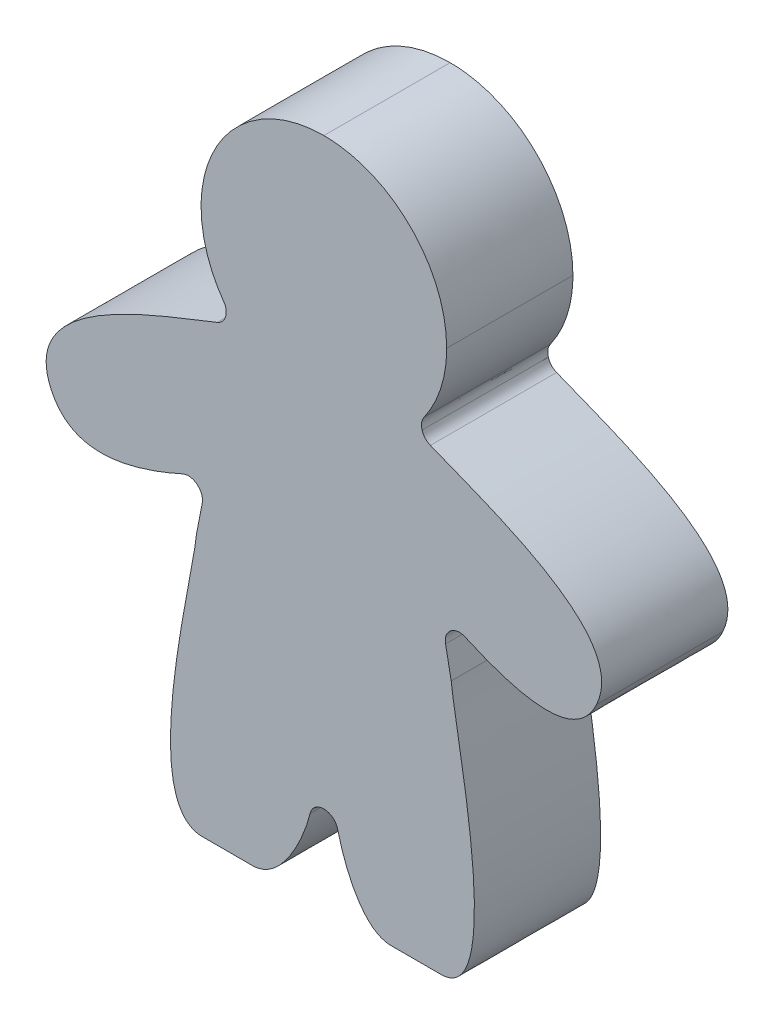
ISO-10303-21;
HEADER;
FILE_DESCRIPTION(('STEP AP214'),'2;1');
FILE_NAME('part.step','',(''),(''),'','','');
FILE_SCHEMA(('AUTOMOTIVE_DESIGN { 1 0 10303 214 1 1 1 1 }'));
ENDSEC;
DATA;
#1=APPLICATION_CONTEXT('core data for automotive mechanical design processes');
#2=APPLICATION_PROTOCOL_DEFINITION('international standard','automotive_design',2000,#1);
#3=PRODUCT_CONTEXT('',#1,'mechanical');
#4=PRODUCT('Part','Part','',(#3));
#5=PRODUCT_RELATED_PRODUCT_CATEGORY('part','',(#4));
#6=PRODUCT_DEFINITION_FORMATION('','',#4);
#7=PRODUCT_DEFINITION_CONTEXT('part definition',#1,'design');
#8=PRODUCT_DEFINITION('design','',#6,#7);
#9=PRODUCT_DEFINITION_SHAPE('','',#8);
#10=(LENGTH_UNIT() NAMED_UNIT(*) SI_UNIT(.MILLI.,.METRE.));
#11=(NAMED_UNIT(*) PLANE_ANGLE_UNIT() SI_UNIT($,.RADIAN.));
#12=(NAMED_UNIT(*) SI_UNIT($,.STERADIAN.) SOLID_ANGLE_UNIT());
#13=UNCERTAINTY_MEASURE_WITH_UNIT(LENGTH_MEASURE(1.E-05),#10,'distance_accuracy_value','');
#14=(GEOMETRIC_REPRESENTATION_CONTEXT(3) GLOBAL_UNCERTAINTY_ASSIGNED_CONTEXT((#13)) GLOBAL_UNIT_ASSIGNED_CONTEXT((#10,
#11,#12)) REPRESENTATION_CONTEXT('',''));
#15=CARTESIAN_POINT('',(0.,0.,0.));
#16=DIRECTION('',(0.,0.,1.));
#17=DIRECTION('',(1.,0.,0.));
#18=AXIS2_PLACEMENT_3D('',#15,#16,#17);
#19=CARTESIAN_POINT('',(349.810712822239,279.948315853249,8.));
#20=CARTESIAN_POINT('',(349.547732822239,280.055505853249,8.));
#21=CARTESIAN_POINT('',(349.365932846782,280.257105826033,8.));
#22=CARTESIAN_POINT('',(349.28637284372,280.529715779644,8.));
#23=B_SPLINE_CURVE_WITH_KNOTS('',3,(#19,#20,#21,#22),.UNSPECIFIED.,.F.,.F.,(4,4),
(0.925925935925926,1.),.UNSPECIFIED.);
#24=DIRECTION('',(0.,0.,-1.));
#25=VECTOR('',#24,1.);
#26=SURFACE_OF_LINEAR_EXTRUSION('',#23,#25);
#27=CARTESIAN_POINT('',(349.810712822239,279.948315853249,0.));
#28=CARTESIAN_POINT('',(349.547732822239,280.055505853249,0.));
#29=CARTESIAN_POINT('',(349.365932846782,280.257105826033,0.));
#30=CARTESIAN_POINT('',(349.28637284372,280.529715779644,0.));
#31=B_SPLINE_CURVE_WITH_KNOTS('',3,(#27,#28,#29,#30),.UNSPECIFIED.,.F.,.F.,(4,4),
(0.925925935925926,1.),.UNSPECIFIED.);
#32=CARTESIAN_POINT('',(349.810712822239,279.948315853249,0.));
#33=VERTEX_POINT('',#32);
#34=CARTESIAN_POINT('',(349.28637284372,280.529715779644,0.));
#35=VERTEX_POINT('',#34);
#36=EDGE_CURVE('E485',#33,#35,#31,.T.);
#37=ORIENTED_EDGE('',*,*,#36,.T.);
#38=DIRECTION('',(0.,0.,-1.));
#39=VECTOR('',#38,1.);
#40=CARTESIAN_POINT('',(349.28637284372,280.529715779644,8.));
#41=LINE('',#40,#39);
#42=CARTESIAN_POINT('',(349.28637284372,280.529715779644,8.));
#43=VERTEX_POINT('',#42);
#44=EDGE_CURVE('E11',#43,#35,#41,.T.);
#45=ORIENTED_EDGE('',*,*,#44,.F.);
#46=CARTESIAN_POINT('',(349.810712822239,279.948315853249,8.));
#47=VERTEX_POINT('',#46);
#48=EDGE_CURVE('E641',#47,#43,#23,.T.);
#49=ORIENTED_EDGE('',*,*,#48,.F.);
#50=DIRECTION('',(0.,0.,-1.));
#51=VECTOR('',#50,1.);
#52=CARTESIAN_POINT('',(349.810712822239,279.948315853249,8.));
#53=LINE('',#52,#51);
#54=EDGE_CURVE('E237',#47,#33,#53,.T.);
#55=ORIENTED_EDGE('',*,*,#54,.T.);
#56=EDGE_LOOP('',(#37,#45,#49,#55));
#57=FACE_BOUND('',#56,.T.);
#58=ADVANCED_FACE('F36',(#57),#26,.F.);
#59=CARTESIAN_POINT('',(349.28637284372,280.529715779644,8.));
#60=CARTESIAN_POINT('',(349.20681284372,280.802415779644,8.));
#61=CARTESIAN_POINT('',(349.251722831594,281.070165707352,8.));
#62=CARTESIAN_POINT('',(349.415882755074,281.301915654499,8.));
#63=B_SPLINE_CURVE_WITH_KNOTS('',3,(#59,#60,#61,#62),.UNSPECIFIED.,.F.,.F.,(4,4),
(0.888888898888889,0.925925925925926),.UNSPECIFIED.);
#64=DIRECTION('',(0.,0.,-1.));
#65=VECTOR('',#64,1.);
#66=SURFACE_OF_LINEAR_EXTRUSION('',#63,#65);
#67=CARTESIAN_POINT('',(349.28637284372,280.529715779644,0.));
#68=CARTESIAN_POINT('',(349.20681284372,280.802415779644,0.));
#69=CARTESIAN_POINT('',(349.251722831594,281.070165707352,0.));
#70=CARTESIAN_POINT('',(349.415882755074,281.301915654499,0.));
#71=B_SPLINE_CURVE_WITH_KNOTS('',3,(#67,#68,#69,#70),.UNSPECIFIED.,.F.,.F.,(4,4),
(0.888888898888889,0.925925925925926),.UNSPECIFIED.);
#72=CARTESIAN_POINT('',(349.415882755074,281.301915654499,0.));
#73=VERTEX_POINT('',#72);
#74=EDGE_CURVE('E479',#35,#73,#71,.T.);
#75=ORIENTED_EDGE('',*,*,#74,.T.);
#76=DIRECTION('',(0.,0.,-1.));
#77=VECTOR('',#76,1.);
#78=CARTESIAN_POINT('',(349.415882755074,281.301915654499,8.));
#79=LINE('',#78,#77);
#80=CARTESIAN_POINT('',(349.415882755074,281.301915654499,8.));
#81=VERTEX_POINT('',#80);
#82=EDGE_CURVE('E45',#81,#73,#79,.T.);
#83=ORIENTED_EDGE('',*,*,#82,.F.);
#84=EDGE_CURVE('E150',#43,#81,#63,.T.);
#85=ORIENTED_EDGE('',*,*,#84,.F.);
#86=ORIENTED_EDGE('',*,*,#44,.T.);
#87=EDGE_LOOP('',(#75,#83,#85,#86));
#88=FACE_BOUND('',#87,.T.);
#89=ADVANCED_FACE('F672',(#88),#66,.F.);
#90=CARTESIAN_POINT('',(349.415882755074,281.301915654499,8.));
#91=CARTESIAN_POINT('',(350.314532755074,282.570915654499,8.));
#92=CARTESIAN_POINT('',(350.842742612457,284.12098523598,8.));
#93=CARTESIAN_POINT('',(350.842742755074,285.794264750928,8.));
#94=B_SPLINE_CURVE_WITH_KNOTS('',3,(#90,#91,#92,#93),.UNSPECIFIED.,.F.,.F.,(4,4),
(0.851851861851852,0.888888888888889),.UNSPECIFIED.);
#95=DIRECTION('',(0.,0.,-1.));
#96=VECTOR('',#95,1.);
#97=SURFACE_OF_LINEAR_EXTRUSION('',#94,#96);
#98=CARTESIAN_POINT('',(349.415882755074,281.301915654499,0.));
#99=CARTESIAN_POINT('',(350.314532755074,282.570915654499,0.));
#100=CARTESIAN_POINT('',(350.842742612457,284.12098523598,0.));
#101=CARTESIAN_POINT('',(350.842742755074,285.794264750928,0.));
#102=B_SPLINE_CURVE_WITH_KNOTS('',3,(#98,#99,#100,#101),.UNSPECIFIED.,.F.,.F.,(4,4),
(0.851851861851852,0.888888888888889),.UNSPECIFIED.);
#103=CARTESIAN_POINT('',(350.842742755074,285.794264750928,0.));
#104=VERTEX_POINT('',#103);
#105=EDGE_CURVE('E473',#73,#104,#102,.T.);
#106=ORIENTED_EDGE('',*,*,#105,.T.);
#107=DIRECTION('',(0.,0.,-1.));
#108=VECTOR('',#107,1.);
#109=CARTESIAN_POINT('',(350.842742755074,285.794264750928,8.));
#110=LINE('',#109,#108);
#111=CARTESIAN_POINT('',(350.842742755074,285.794264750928,8.));
#112=VERTEX_POINT('',#111);
#113=EDGE_CURVE('E465',#112,#104,#110,.T.);
#114=ORIENTED_EDGE('',*,*,#113,.F.);
#115=EDGE_CURVE('E474',#81,#112,#94,.T.);
#116=ORIENTED_EDGE('',*,*,#115,.F.);
#117=ORIENTED_EDGE('',*,*,#82,.T.);
#118=EDGE_LOOP('',(#106,#114,#116,#117));
#119=FACE_BOUND('',#118,.T.);
#120=ADVANCED_FACE('F471',(#119),#97,.F.);
#121=CARTESIAN_POINT('',(350.842742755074,285.794264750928,8.));
#122=CARTESIAN_POINT('',(350.842744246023,290.092034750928,8.));
#123=CARTESIAN_POINT('',(347.358666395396,293.576115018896,8.));
#124=CARTESIAN_POINT('',(343.06089777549,293.576117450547,8.));
#125=B_SPLINE_CURVE_WITH_KNOTS('',3,(#121,#122,#123,#124),.UNSPECIFIED.,.F.,.F.,(4,4),
(0.814814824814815,0.851851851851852),.UNSPECIFIED.);
#126=DIRECTION('',(0.,0.,-1.));
#127=VECTOR('',#126,1.);
#128=SURFACE_OF_LINEAR_EXTRUSION('',#125,#127);
#129=CARTESIAN_POINT('',(350.842742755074,285.794264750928,0.));
#130=CARTESIAN_POINT('',(350.842744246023,290.092034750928,0.));
#131=CARTESIAN_POINT('',(347.358666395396,293.576115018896,0.));
#132=CARTESIAN_POINT('',(343.06089777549,293.576117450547,0.));
#133=B_SPLINE_CURVE_WITH_KNOTS('',3,(#129,#130,#131,#132),.UNSPECIFIED.,.F.,.F.,(4,4),
(0.814814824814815,0.851851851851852),.UNSPECIFIED.);
#134=CARTESIAN_POINT('',(343.06089777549,293.576117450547,0.));
#135=VERTEX_POINT('',#134);
#136=EDGE_CURVE('E481',#104,#135,#133,.T.);
#137=ORIENTED_EDGE('',*,*,#136,.T.);
#138=DIRECTION('',(0.,0.,-1.));
#139=VECTOR('',#138,1.);
#140=CARTESIAN_POINT('',(343.06089777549,293.576117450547,8.));
#141=LINE('',#140,#139);
#142=CARTESIAN_POINT('',(343.06089777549,293.576117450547,8.));
#143=VERTEX_POINT('',#142);
#144=EDGE_CURVE('E462',#143,#135,#141,.T.);
#145=ORIENTED_EDGE('',*,*,#144,.F.);
#146=EDGE_CURVE('E684',#112,#143,#125,.T.);
#147=ORIENTED_EDGE('',*,*,#146,.F.);
#148=ORIENTED_EDGE('',*,*,#113,.T.);
#149=EDGE_LOOP('',(#137,#145,#147,#148));
#150=FACE_BOUND('',#149,.T.);
#151=ADVANCED_FACE('F677',(#150),#128,.F.);
#152=CARTESIAN_POINT('',(343.06089777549,293.576117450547,8.));
#153=CARTESIAN_POINT('',(338.763127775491,293.576115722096,8.));
#154=CARTESIAN_POINT('',(335.279050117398,290.092035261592,8.));
#155=CARTESIAN_POINT('',(335.279050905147,285.794266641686,8.));
#156=B_SPLINE_CURVE_WITH_KNOTS('',3,(#152,#153,#154,#155),.UNSPECIFIED.,.F.,.F.,(4,4),
(0.777777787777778,0.814814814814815),.UNSPECIFIED.);
#157=DIRECTION('',(0.,0.,-1.));
#158=VECTOR('',#157,1.);
#159=SURFACE_OF_LINEAR_EXTRUSION('',#156,#158);
#160=CARTESIAN_POINT('',(343.06089777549,293.576117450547,0.));
#161=CARTESIAN_POINT('',(338.763127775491,293.576115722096,0.));
#162=CARTESIAN_POINT('',(335.279050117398,290.092035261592,0.));
#163=CARTESIAN_POINT('',(335.279050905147,285.794266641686,0.));
#164=B_SPLINE_CURVE_WITH_KNOTS('',3,(#160,#161,#162,#163),.UNSPECIFIED.,.F.,.F.,(4,4),
(0.777777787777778,0.814814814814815),.UNSPECIFIED.);
#165=CARTESIAN_POINT('',(335.279050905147,285.794266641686,0.));
#166=VERTEX_POINT('',#165);
#167=EDGE_CURVE('E483',#135,#166,#164,.T.);
#168=ORIENTED_EDGE('',*,*,#167,.T.);
#169=DIRECTION('',(0.,0.,-1.));
#170=VECTOR('',#169,1.);
#171=CARTESIAN_POINT('',(335.279050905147,285.794266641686,8.));
#172=LINE('',#171,#170);
#173=CARTESIAN_POINT('',(335.279050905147,285.794266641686,8.));
#174=VERTEX_POINT('',#173);
#175=EDGE_CURVE('E459',#174,#166,#172,.T.);
#176=ORIENTED_EDGE('',*,*,#175,.F.);
#177=EDGE_CURVE('E688',#143,#174,#156,.T.);
#178=ORIENTED_EDGE('',*,*,#177,.F.);
#179=ORIENTED_EDGE('',*,*,#144,.T.);
#180=EDGE_LOOP('',(#168,#176,#178,#179));
#181=FACE_BOUND('',#180,.T.);
#182=ADVANCED_FACE('F680',(#181),#159,.F.);
#183=CARTESIAN_POINT('',(335.279050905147,285.794266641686,8.));
#184=CARTESIAN_POINT('',(335.279050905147,284.120896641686,8.));
#185=CARTESIAN_POINT('',(335.80726076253,282.570917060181,8.));
#186=CARTESIAN_POINT('',(336.706000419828,281.301917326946,8.));
#187=B_SPLINE_CURVE_WITH_KNOTS('',3,(#183,#184,#185,#186),.UNSPECIFIED.,.F.,.F.,(4,4),
(0.740740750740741,0.777777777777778),.UNSPECIFIED.);
#188=DIRECTION('',(0.,0.,-1.));
#189=VECTOR('',#188,1.);
#190=SURFACE_OF_LINEAR_EXTRUSION('',#187,#189);
#191=CARTESIAN_POINT('',(335.279050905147,285.794266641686,0.));
#192=CARTESIAN_POINT('',(335.279050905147,284.120896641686,0.));
#193=CARTESIAN_POINT('',(335.80726076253,282.570917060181,0.));
#194=CARTESIAN_POINT('',(336.706000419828,281.301917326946,0.));
#195=B_SPLINE_CURVE_WITH_KNOTS('',3,(#191,#192,#193,#194),.UNSPECIFIED.,.F.,.F.,(4,4),
(0.740740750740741,0.777777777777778),.UNSPECIFIED.);
#196=CARTESIAN_POINT('',(336.706000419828,281.301917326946,0.));
#197=VERTEX_POINT('',#196);
#198=EDGE_CURVE('E503',#166,#197,#195,.T.);
#199=ORIENTED_EDGE('',*,*,#198,.T.);
#200=DIRECTION('',(0.,0.,-1.));
#201=VECTOR('',#200,1.);
#202=CARTESIAN_POINT('',(336.706000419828,281.301917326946,8.));
#203=LINE('',#202,#201);
#204=CARTESIAN_POINT('',(336.706000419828,281.301917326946,8.));
#205=VERTEX_POINT('',#204);
#206=EDGE_CURVE('E456',#205,#197,#203,.T.);
#207=ORIENTED_EDGE('',*,*,#206,.F.);
#208=EDGE_CURVE('E696',#174,#205,#187,.T.);
#209=ORIENTED_EDGE('',*,*,#208,.F.);
#210=ORIENTED_EDGE('',*,*,#175,.T.);
#211=EDGE_LOOP('',(#199,#207,#209,#210));
#212=FACE_BOUND('',#211,.T.);
#213=ADVANCED_FACE('F712',(#212),#190,.F.);
#214=CARTESIAN_POINT('',(336.706000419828,281.301917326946,8.));
#215=CARTESIAN_POINT('',(336.870160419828,281.070167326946,8.));
#216=CARTESIAN_POINT('',(336.915070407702,280.802417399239,8.));
#217=CARTESIAN_POINT('',(336.83551046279,280.529717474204,8.));
#218=B_SPLINE_CURVE_WITH_KNOTS('',3,(#214,#215,#216,#217),.UNSPECIFIED.,.F.,.F.,(4,4),
(0.703703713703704,0.740740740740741),.UNSPECIFIED.);
#219=DIRECTION('',(0.,0.,-1.));
#220=VECTOR('',#219,1.);
#221=SURFACE_OF_LINEAR_EXTRUSION('',#218,#220);
#222=CARTESIAN_POINT('',(336.706000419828,281.301917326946,0.));
#223=CARTESIAN_POINT('',(336.870160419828,281.070167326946,0.));
#224=CARTESIAN_POINT('',(336.915070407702,280.802417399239,0.));
#225=CARTESIAN_POINT('',(336.83551046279,280.529717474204,0.));
#226=B_SPLINE_CURVE_WITH_KNOTS('',3,(#222,#223,#224,#225),.UNSPECIFIED.,.F.,.F.,(4,4),
(0.703703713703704,0.740740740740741),.UNSPECIFIED.);
#227=CARTESIAN_POINT('',(336.83551046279,280.529717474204,0.));
#228=VERTEX_POINT('',#227);
#229=EDGE_CURVE('E510',#197,#228,#226,.T.);
#230=ORIENTED_EDGE('',*,*,#229,.T.);
#231=DIRECTION('',(0.,0.,-1.));
#232=VECTOR('',#231,1.);
#233=CARTESIAN_POINT('',(336.83551046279,280.529717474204,8.));
#234=LINE('',#233,#232);
#235=CARTESIAN_POINT('',(336.83551046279,280.529717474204,8.));
#236=VERTEX_POINT('',#235);
#237=EDGE_CURVE('E453',#236,#228,#234,.T.);
#238=ORIENTED_EDGE('',*,*,#237,.F.);
#239=EDGE_CURVE('E704',#205,#236,#218,.T.);
#240=ORIENTED_EDGE('',*,*,#239,.F.);
#241=ORIENTED_EDGE('',*,*,#206,.T.);
#242=EDGE_LOOP('',(#230,#238,#240,#241));
#243=FACE_BOUND('',#242,.T.);
#244=ADVANCED_FACE('F715',(#243),#221,.F.);
#245=CARTESIAN_POINT('',(336.83551046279,280.529717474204,8.));
#246=CARTESIAN_POINT('',(336.75595046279,280.257017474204,8.));
#247=CARTESIAN_POINT('',(336.574240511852,280.055417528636,8.));
#248=CARTESIAN_POINT('',(336.311170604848,279.948227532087,8.));
#249=B_SPLINE_CURVE_WITH_KNOTS('',3,(#245,#246,#247,#248),.UNSPECIFIED.,.F.,.F.,(4,4),
(0.666666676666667,0.703703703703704),.UNSPECIFIED.);
#250=DIRECTION('',(0.,0.,-1.));
#251=VECTOR('',#250,1.);
#252=SURFACE_OF_LINEAR_EXTRUSION('',#249,#251);
#253=CARTESIAN_POINT('',(336.83551046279,280.529717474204,0.));
#254=CARTESIAN_POINT('',(336.75595046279,280.257017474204,0.));
#255=CARTESIAN_POINT('',(336.574240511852,280.055417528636,0.));
#256=CARTESIAN_POINT('',(336.311170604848,279.948227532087,0.));
#257=B_SPLINE_CURVE_WITH_KNOTS('',3,(#253,#254,#255,#256),.UNSPECIFIED.,.F.,.F.,(4,4),
(0.666666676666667,0.703703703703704),.UNSPECIFIED.);
#258=CARTESIAN_POINT('',(336.311170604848,279.948227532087,0.));
#259=VERTEX_POINT('',#258);
#260=EDGE_CURVE('E517',#228,#259,#257,.T.);
#261=ORIENTED_EDGE('',*,*,#260,.T.);
#262=DIRECTION('',(0.,0.,-1.));
#263=VECTOR('',#262,1.);
#264=CARTESIAN_POINT('',(336.311170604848,279.948227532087,8.));
#265=LINE('',#264,#263);
#266=CARTESIAN_POINT('',(336.311170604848,279.948227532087,8.));
#267=VERTEX_POINT('',#266);
#268=EDGE_CURVE('E450',#267,#259,#265,.T.);
#269=ORIENTED_EDGE('',*,*,#268,.F.);
#270=EDGE_CURVE('E727',#236,#267,#249,.T.);
#271=ORIENTED_EDGE('',*,*,#270,.F.);
#272=ORIENTED_EDGE('',*,*,#237,.T.);
#273=EDGE_LOOP('',(#261,#269,#271,#272));
#274=FACE_BOUND('',#273,.T.);
#275=ADVANCED_FACE('F719',(#274),#252,.F.);
#276=CARTESIAN_POINT('',(336.311170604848,279.948227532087,8.));
#277=CARTESIAN_POINT('',(332.062810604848,278.218247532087,8.));
#278=CARTESIAN_POINT('',(323.70784286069,275.43697828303,8.));
#279=CARTESIAN_POINT('',(325.787469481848,270.977209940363,8.));
#280=B_SPLINE_CURVE_WITH_KNOTS('',3,(#276,#277,#278,#279),.UNSPECIFIED.,.F.,.F.,(4,4),
(0.62962963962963,0.666666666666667),.UNSPECIFIED.);
#281=DIRECTION('',(0.,0.,-1.));
#282=VECTOR('',#281,1.);
#283=SURFACE_OF_LINEAR_EXTRUSION('',#280,#282);
#284=CARTESIAN_POINT('',(336.311170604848,279.948227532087,0.));
#285=CARTESIAN_POINT('',(332.062810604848,278.218247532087,0.));
#286=CARTESIAN_POINT('',(323.70784286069,275.43697828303,0.));
#287=CARTESIAN_POINT('',(325.787469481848,270.977209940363,0.));
#288=B_SPLINE_CURVE_WITH_KNOTS('',3,(#284,#285,#286,#287),.UNSPECIFIED.,.F.,.F.,(4,4),
(0.62962963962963,0.666666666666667),.UNSPECIFIED.);
#289=CARTESIAN_POINT('',(325.787469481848,270.977209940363,0.));
#290=VERTEX_POINT('',#289);
#291=EDGE_CURVE('E524',#259,#290,#288,.T.);
#292=ORIENTED_EDGE('',*,*,#291,.T.);
#293=DIRECTION('',(0.,0.,-1.));
#294=VECTOR('',#293,1.);
#295=CARTESIAN_POINT('',(325.787469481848,270.977209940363,8.));
#296=LINE('',#295,#294);
#297=CARTESIAN_POINT('',(325.787469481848,270.977209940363,8.));
#298=VERTEX_POINT('',#297);
#299=EDGE_CURVE('E447',#298,#290,#296,.T.);
#300=ORIENTED_EDGE('',*,*,#299,.F.);
#301=EDGE_CURVE('E731',#267,#298,#280,.T.);
#302=ORIENTED_EDGE('',*,*,#301,.F.);
#303=ORIENTED_EDGE('',*,*,#268,.T.);
#304=EDGE_LOOP('',(#292,#300,#302,#303));
#305=FACE_BOUND('',#304,.T.);
#306=ADVANCED_FACE('F723',(#305),#283,.F.);
#307=CARTESIAN_POINT('',(325.787469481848,270.977209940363,8.));
#308=CARTESIAN_POINT('',(327.115779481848,268.128529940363,8.));
#309=CARTESIAN_POINT('',(330.656198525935,268.981369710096,8.));
#310=CARTESIAN_POINT('',(334.097707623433,270.527569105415,8.));
#311=B_SPLINE_CURVE_WITH_KNOTS('',3,(#307,#308,#309,#310),.UNSPECIFIED.,.F.,.F.,(4,4),
(0.592592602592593,0.62962962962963),.UNSPECIFIED.);
#312=DIRECTION('',(0.,0.,-1.));
#313=VECTOR('',#312,1.);
#314=SURFACE_OF_LINEAR_EXTRUSION('',#311,#313);
#315=CARTESIAN_POINT('',(325.787469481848,270.977209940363,0.));
#316=CARTESIAN_POINT('',(327.115779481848,268.128529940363,0.));
#317=CARTESIAN_POINT('',(330.656198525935,268.981369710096,0.));
#318=CARTESIAN_POINT('',(334.097707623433,270.527569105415,0.));
#319=B_SPLINE_CURVE_WITH_KNOTS('',3,(#315,#316,#317,#318),.UNSPECIFIED.,.F.,.F.,(4,4),
(0.592592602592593,0.62962962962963),.UNSPECIFIED.);
#320=CARTESIAN_POINT('',(334.097707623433,270.527569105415,0.));
#321=VERTEX_POINT('',#320);
#322=EDGE_CURVE('E531',#290,#321,#319,.T.);
#323=ORIENTED_EDGE('',*,*,#322,.T.);
#324=DIRECTION('',(0.,0.,-1.));
#325=VECTOR('',#324,1.);
#326=CARTESIAN_POINT('',(334.097707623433,270.527569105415,8.));
#327=LINE('',#326,#325);
#328=CARTESIAN_POINT('',(334.097707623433,270.527569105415,8.));
#329=VERTEX_POINT('',#328);
#330=EDGE_CURVE('E444',#329,#321,#327,.T.);
#331=ORIENTED_EDGE('',*,*,#330,.F.);
#332=EDGE_CURVE('E739',#298,#329,#311,.T.);
#333=ORIENTED_EDGE('',*,*,#332,.F.);
#334=ORIENTED_EDGE('',*,*,#299,.T.);
#335=EDGE_LOOP('',(#323,#331,#333,#334));
#336=FACE_BOUND('',#335,.T.);
#337=ADVANCED_FACE('F754',(#336),#314,.F.);
#338=CARTESIAN_POINT('',(334.097707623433,270.527569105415,8.));
#339=CARTESIAN_POINT('',(334.412077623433,270.668779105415,8.));
#340=CARTESIAN_POINT('',(334.755157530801,270.626119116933,8.));
#341=CARTESIAN_POINT('',(335.025337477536,270.412189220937,8.));
#342=B_SPLINE_CURVE_WITH_KNOTS('',3,(#338,#339,#340,#341),.UNSPECIFIED.,.F.,.F.,(4,4),
(0.555555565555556,0.592592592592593),.UNSPECIFIED.);
#343=DIRECTION('',(0.,0.,-1.));
#344=VECTOR('',#343,1.);
#345=SURFACE_OF_LINEAR_EXTRUSION('',#342,#344);
#346=CARTESIAN_POINT('',(334.097707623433,270.527569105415,0.));
#347=CARTESIAN_POINT('',(334.412077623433,270.668779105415,0.));
#348=CARTESIAN_POINT('',(334.755157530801,270.626119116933,0.));
#349=CARTESIAN_POINT('',(335.025337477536,270.412189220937,0.));
#350=B_SPLINE_CURVE_WITH_KNOTS('',3,(#346,#347,#348,#349),.UNSPECIFIED.,.F.,.F.,(4,4),
(0.555555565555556,0.592592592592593),.UNSPECIFIED.);
#351=CARTESIAN_POINT('',(335.025337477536,270.412189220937,0.));
#352=VERTEX_POINT('',#351);
#353=EDGE_CURVE('E538',#321,#352,#350,.T.);
#354=ORIENTED_EDGE('',*,*,#353,.T.);
#355=DIRECTION('',(0.,0.,-1.));
#356=VECTOR('',#355,1.);
#357=CARTESIAN_POINT('',(335.025337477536,270.412189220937,8.));
#358=LINE('',#357,#356);
#359=CARTESIAN_POINT('',(335.025337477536,270.412189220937,8.));
#360=VERTEX_POINT('',#359);
#361=EDGE_CURVE('E441',#360,#352,#358,.T.);
#362=ORIENTED_EDGE('',*,*,#361,.F.);
#363=EDGE_CURVE('E747',#329,#360,#342,.T.);
#364=ORIENTED_EDGE('',*,*,#363,.F.);
#365=ORIENTED_EDGE('',*,*,#330,.T.);
#366=EDGE_LOOP('',(#354,#362,#364,#365));
#367=FACE_BOUND('',#366,.T.);
#368=ADVANCED_FACE('F757',(#367),#345,.F.);
#369=CARTESIAN_POINT('',(335.025337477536,270.412189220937,8.));
#370=CARTESIAN_POINT('',(335.295517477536,270.198169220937,8.));
#371=CARTESIAN_POINT('',(335.41557744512,269.873989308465,8.));
#372=CARTESIAN_POINT('',(335.350147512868,269.535679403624,8.));
#373=B_SPLINE_CURVE_WITH_KNOTS('',3,(#369,#370,#371,#372),.UNSPECIFIED.,.F.,.F.,(4,4),
(0.518518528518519,0.555555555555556),.UNSPECIFIED.);
#374=DIRECTION('',(0.,0.,-1.));
#375=VECTOR('',#374,1.);
#376=SURFACE_OF_LINEAR_EXTRUSION('',#373,#375);
#377=CARTESIAN_POINT('',(335.025337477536,270.412189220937,0.));
#378=CARTESIAN_POINT('',(335.295517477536,270.198169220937,0.));
#379=CARTESIAN_POINT('',(335.41557744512,269.873989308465,0.));
#380=CARTESIAN_POINT('',(335.350147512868,269.535679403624,0.));
#381=B_SPLINE_CURVE_WITH_KNOTS('',3,(#377,#378,#379,#380),.UNSPECIFIED.,.F.,.F.,(4,4),
(0.518518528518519,0.555555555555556),.UNSPECIFIED.);
#382=CARTESIAN_POINT('',(335.350147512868,269.535679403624,0.));
#383=VERTEX_POINT('',#382);
#384=EDGE_CURVE('E545',#352,#383,#381,.T.);
#385=ORIENTED_EDGE('',*,*,#384,.T.);
#386=DIRECTION('',(0.,0.,-1.));
#387=VECTOR('',#386,1.);
#388=CARTESIAN_POINT('',(335.350147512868,269.535679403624,8.));
#389=LINE('',#388,#387);
#390=CARTESIAN_POINT('',(335.350147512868,269.535679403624,8.));
#391=VERTEX_POINT('',#390);
#392=EDGE_CURVE('E438',#391,#383,#389,.T.);
#393=ORIENTED_EDGE('',*,*,#392,.F.);
#394=EDGE_CURVE('E764',#360,#391,#373,.T.);
#395=ORIENTED_EDGE('',*,*,#394,.F.);
#396=ORIENTED_EDGE('',*,*,#361,.T.);
#397=EDGE_LOOP('',(#385,#393,#395,#396));
#398=FACE_BOUND('',#397,.T.);
#399=ADVANCED_FACE('F760',(#398),#376,.F.);
#400=CARTESIAN_POINT('',(335.350147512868,269.535679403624,8.));
#401=DIRECTION('',(0.981783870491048,-0.190001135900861,0.));
#402=DIRECTION('',(0.190001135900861,0.981783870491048,0.));
#403=AXIS2_PLACEMENT_3D('',#400,#401,#402);
#404=PLANE('',#403);
#405=CARTESIAN_POINT('',(335.350147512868,269.535679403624,0.));
#406=CARTESIAN_POINT('',(334.991767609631,267.683839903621,0.));
#407=CARTESIAN_POINT('',(334.991767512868,267.683839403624,0.));
#408=B_SPLINE_CURVE_WITH_KNOTS('',2,(#405,#406,#407),.UNSPECIFIED.,.F.,.F.,(3,3),
(0.481481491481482,0.518518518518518),.UNSPECIFIED.);
#409=CARTESIAN_POINT('',(334.991767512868,267.683839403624,0.));
#410=VERTEX_POINT('',#409);
#411=EDGE_CURVE('E552',#383,#410,#408,.T.);
#412=ORIENTED_EDGE('',*,*,#411,.T.);
#413=DIRECTION('',(0.,0.,-1.));
#414=VECTOR('',#413,1.);
#415=CARTESIAN_POINT('',(334.991767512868,267.683839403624,8.));
#416=LINE('',#415,#414);
#417=CARTESIAN_POINT('',(334.991767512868,267.683839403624,8.));
#418=VERTEX_POINT('',#417);
#419=EDGE_CURVE('E435',#418,#410,#416,.T.);
#420=ORIENTED_EDGE('',*,*,#419,.F.);
#421=CARTESIAN_POINT('',(335.350147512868,269.535679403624,8.));
#422=CARTESIAN_POINT('',(334.991767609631,267.683839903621,8.));
#423=CARTESIAN_POINT('',(334.991767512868,267.683839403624,8.));
#424=B_SPLINE_CURVE_WITH_KNOTS('',2,(#421,#422,#423),.UNSPECIFIED.,.F.,.F.,(3,3),
(0.481481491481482,0.518518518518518),.UNSPECIFIED.);
#425=EDGE_CURVE('E361',#391,#418,#424,.T.);
#426=ORIENTED_EDGE('',*,*,#425,.F.);
#427=ORIENTED_EDGE('',*,*,#392,.T.);
#428=EDGE_LOOP('',(#412,#420,#426,#427));
#429=FACE_BOUND('',#428,.T.);
#430=ADVANCED_FACE('F352',(#429),#404,.F.);
#431=CARTESIAN_POINT('',(334.991767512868,267.683839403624,8.));
#432=CARTESIAN_POINT('',(334.766137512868,265.105249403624,8.));
#433=CARTESIAN_POINT('',(331.154258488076,251.24660314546,8.));
#434=CARTESIAN_POINT('',(335.373095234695,251.246599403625,8.));
#435=B_SPLINE_CURVE_WITH_KNOTS('',3,(#431,#432,#433,#434),.UNSPECIFIED.,.F.,.F.,(4,4),
(0.444444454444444,0.481481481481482),.UNSPECIFIED.);
#436=DIRECTION('',(0.,0.,-1.));
#437=VECTOR('',#436,1.);
#438=SURFACE_OF_LINEAR_EXTRUSION('',#435,#437);
#439=CARTESIAN_POINT('',(334.991767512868,267.683839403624,0.));
#440=CARTESIAN_POINT('',(334.766137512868,265.105249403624,0.));
#441=CARTESIAN_POINT('',(331.154258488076,251.24660314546,0.));
#442=CARTESIAN_POINT('',(335.373095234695,251.246599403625,0.));
#443=B_SPLINE_CURVE_WITH_KNOTS('',3,(#439,#440,#441,#442),.UNSPECIFIED.,.F.,.F.,(4,4),
(0.444444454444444,0.481481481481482),.UNSPECIFIED.);
#444=CARTESIAN_POINT('',(335.373095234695,251.246599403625,0.));
#445=VERTEX_POINT('',#444);
#446=EDGE_CURVE('E559',#410,#445,#443,.T.);
#447=ORIENTED_EDGE('',*,*,#446,.T.);
#448=DIRECTION('',(0.,0.,-1.));
#449=VECTOR('',#448,1.);
#450=CARTESIAN_POINT('',(335.373095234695,251.246599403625,8.));
#451=LINE('',#450,#449);
#452=CARTESIAN_POINT('',(335.373095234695,251.246599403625,8.));
#453=VERTEX_POINT('',#452);
#454=EDGE_CURVE('E432',#453,#445,#451,.T.);
#455=ORIENTED_EDGE('',*,*,#454,.F.);
#456=EDGE_CURVE('E355',#418,#453,#435,.T.);
#457=ORIENTED_EDGE('',*,*,#456,.F.);
#458=ORIENTED_EDGE('',*,*,#419,.T.);
#459=EDGE_LOOP('',(#447,#455,#457,#458));
#460=FACE_BOUND('',#459,.T.);
#461=ADVANCED_FACE('F347',(#460),#438,.F.);
#462=CARTESIAN_POINT('',(335.373095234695,251.246599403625,8.));
#463=DIRECTION('',(0.,1.,0.));
#464=DIRECTION('',(-1.,0.,0.));
#465=AXIS2_PLACEMENT_3D('',#462,#463,#464);
#466=PLANE('',#465);
#467=CARTESIAN_POINT('',(335.373095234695,251.246599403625,0.));
#468=CARTESIAN_POINT('',(338.529844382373,251.246599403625,0.));
#469=CARTESIAN_POINT('',(338.529845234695,251.246599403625,0.));
#470=B_SPLINE_CURVE_WITH_KNOTS('',2,(#467,#468,#469),.UNSPECIFIED.,.F.,.F.,(3,3),
(0.407407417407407,0.444444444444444),.UNSPECIFIED.);
#471=CARTESIAN_POINT('',(338.529845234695,251.246599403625,0.));
#472=VERTEX_POINT('',#471);
#473=EDGE_CURVE('E566',#445,#472,#470,.T.);
#474=ORIENTED_EDGE('',*,*,#473,.T.);
#475=DIRECTION('',(0.,0.,-1.));
#476=VECTOR('',#475,1.);
#477=CARTESIAN_POINT('',(338.529845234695,251.246599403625,8.));
#478=LINE('',#477,#476);
#479=CARTESIAN_POINT('',(338.529845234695,251.246599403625,8.));
#480=VERTEX_POINT('',#479);
#481=EDGE_CURVE('E385',#480,#472,#478,.T.);
#482=ORIENTED_EDGE('',*,*,#481,.F.);
#483=CARTESIAN_POINT('',(335.373095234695,251.246599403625,8.));
#484=CARTESIAN_POINT('',(338.529844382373,251.246599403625,8.));
#485=CARTESIAN_POINT('',(338.529845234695,251.246599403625,8.));
#486=B_SPLINE_CURVE_WITH_KNOTS('',2,(#483,#484,#485),.UNSPECIFIED.,.F.,.F.,(3,3),
(0.407407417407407,0.444444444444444),.UNSPECIFIED.);
#487=EDGE_CURVE('E360',#453,#480,#486,.T.);
#488=ORIENTED_EDGE('',*,*,#487,.F.);
#489=ORIENTED_EDGE('',*,*,#454,.T.);
#490=EDGE_LOOP('',(#474,#482,#488,#489));
#491=FACE_BOUND('',#490,.T.);
#492=ADVANCED_FACE('F343',(#491),#466,.F.);
#493=CARTESIAN_POINT('',(338.529845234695,251.246599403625,8.));
#494=CARTESIAN_POINT('',(340.443245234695,251.246599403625,8.));
#495=CARTESIAN_POINT('',(341.837164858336,254.438898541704,8.));
#496=CARTESIAN_POINT('',(342.184835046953,255.924798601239,8.));
#497=B_SPLINE_CURVE_WITH_KNOTS('',3,(#493,#494,#495,#496),.UNSPECIFIED.,.F.,.F.,(4,4),
(0.37037038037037,0.407407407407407),.UNSPECIFIED.);
#498=DIRECTION('',(0.,0.,-1.));
#499=VECTOR('',#498,1.);
#500=SURFACE_OF_LINEAR_EXTRUSION('',#497,#499);
#501=CARTESIAN_POINT('',(338.529845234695,251.246599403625,0.));
#502=CARTESIAN_POINT('',(340.443245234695,251.246599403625,0.));
#503=CARTESIAN_POINT('',(341.837164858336,254.438898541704,0.));
#504=CARTESIAN_POINT('',(342.184835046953,255.924798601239,0.));
#505=B_SPLINE_CURVE_WITH_KNOTS('',3,(#501,#502,#503,#504),.UNSPECIFIED.,.F.,.F.,(4,4),
(0.37037038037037,0.407407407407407),.UNSPECIFIED.);
#506=CARTESIAN_POINT('',(342.184835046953,255.924798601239,0.));
#507=VERTEX_POINT('',#506);
#508=EDGE_CURVE('E383',#472,#507,#505,.T.);
#509=ORIENTED_EDGE('',*,*,#508,.T.);
#510=DIRECTION('',(0.,0.,-1.));
#511=VECTOR('',#510,1.);
#512=CARTESIAN_POINT('',(342.184835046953,255.924798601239,8.));
#513=LINE('',#512,#511);
#514=CARTESIAN_POINT('',(342.184835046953,255.924798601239,8.));
#515=VERTEX_POINT('',#514);
#516=EDGE_CURVE('E381',#515,#507,#513,.T.);
#517=ORIENTED_EDGE('',*,*,#516,.F.);
#518=EDGE_CURVE('E328',#480,#515,#497,.T.);
#519=ORIENTED_EDGE('',*,*,#518,.F.);
#520=ORIENTED_EDGE('',*,*,#481,.T.);
#521=EDGE_LOOP('',(#509,#517,#519,#520));
#522=FACE_BOUND('',#521,.T.);
#523=ADVANCED_FACE('F339',(#522),#500,.F.);
#524=CARTESIAN_POINT('',(342.184835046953,255.924798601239,8.));
#525=CARTESIAN_POINT('',(342.281045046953,256.336008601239,8.));
#526=CARTESIAN_POINT('',(342.637804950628,256.619508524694,8.));
#527=CARTESIAN_POINT('',(343.060894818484,256.619598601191,8.));
#528=B_SPLINE_CURVE_WITH_KNOTS('',3,(#524,#525,#526,#527),.UNSPECIFIED.,.F.,.F.,(4,4),
(0.333333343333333,0.37037037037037),.UNSPECIFIED.);
#529=DIRECTION('',(0.,0.,-1.));
#530=VECTOR('',#529,1.);
#531=SURFACE_OF_LINEAR_EXTRUSION('',#528,#530);
#532=CARTESIAN_POINT('',(342.184835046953,255.924798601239,0.));
#533=CARTESIAN_POINT('',(342.281045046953,256.336008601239,0.));
#534=CARTESIAN_POINT('',(342.637804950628,256.619508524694,0.));
#535=CARTESIAN_POINT('',(343.060894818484,256.619598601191,0.));
#536=B_SPLINE_CURVE_WITH_KNOTS('',3,(#532,#533,#534,#535),.UNSPECIFIED.,.F.,.F.,(4,4),
(0.333333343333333,0.37037037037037),.UNSPECIFIED.);
#537=CARTESIAN_POINT('',(343.060894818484,256.619598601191,0.));
#538=VERTEX_POINT('',#537);
#539=EDGE_CURVE('E390',#507,#538,#536,.T.);
#540=ORIENTED_EDGE('',*,*,#539,.T.);
#541=DIRECTION('',(0.,0.,-1.));
#542=VECTOR('',#541,1.);
#543=CARTESIAN_POINT('',(343.060894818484,256.619598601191,8.));
#544=LINE('',#543,#542);
#545=CARTESIAN_POINT('',(343.060894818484,256.619598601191,8.));
#546=VERTEX_POINT('',#545);
#547=EDGE_CURVE('E386',#546,#538,#544,.T.);
#548=ORIENTED_EDGE('',*,*,#547,.F.);
#549=EDGE_CURVE('E320',#515,#546,#528,.T.);
#550=ORIENTED_EDGE('',*,*,#549,.F.);
#551=ORIENTED_EDGE('',*,*,#516,.T.);
#552=EDGE_LOOP('',(#540,#548,#550,#551));
#553=FACE_BOUND('',#552,.T.);
#554=ADVANCED_FACE('F336',(#553),#531,.F.);
#555=CARTESIAN_POINT('',(343.060894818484,256.619598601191,8.));
#556=CARTESIAN_POINT('',(343.483894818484,256.619598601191,8.));
#557=CARTESIAN_POINT('',(343.84083472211,256.336098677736,8.));
#558=CARTESIAN_POINT('',(343.937044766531,255.924798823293,8.));
#559=B_SPLINE_CURVE_WITH_KNOTS('',3,(#555,#556,#557,#558),.UNSPECIFIED.,.F.,.F.,(4,4),
(0.296296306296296,0.333333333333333),.UNSPECIFIED.);
#560=DIRECTION('',(0.,0.,-1.));
#561=VECTOR('',#560,1.);
#562=SURFACE_OF_LINEAR_EXTRUSION('',#559,#561);
#563=CARTESIAN_POINT('',(343.060894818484,256.619598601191,0.));
#564=CARTESIAN_POINT('',(343.483894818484,256.619598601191,0.));
#565=CARTESIAN_POINT('',(343.84083472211,256.336098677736,0.));
#566=CARTESIAN_POINT('',(343.937044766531,255.924798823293,0.));
#567=B_SPLINE_CURVE_WITH_KNOTS('',3,(#563,#564,#565,#566),.UNSPECIFIED.,.F.,.F.,(4,4),
(0.296296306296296,0.333333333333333),.UNSPECIFIED.);
#568=CARTESIAN_POINT('',(343.937044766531,255.924798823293,0.));
#569=VERTEX_POINT('',#568);
#570=EDGE_CURVE('E585',#538,#569,#567,.T.);
#571=ORIENTED_EDGE('',*,*,#570,.T.);
#572=DIRECTION('',(0.,0.,-1.));
#573=VECTOR('',#572,1.);
#574=CARTESIAN_POINT('',(343.937044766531,255.924798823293,8.));
#575=LINE('',#574,#573);
#576=CARTESIAN_POINT('',(343.937044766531,255.924798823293,8.));
#577=VERTEX_POINT('',#576);
#578=EDGE_CURVE('E393',#577,#569,#575,.T.);
#579=ORIENTED_EDGE('',*,*,#578,.F.);
#580=EDGE_CURVE('E312',#546,#577,#559,.T.);
#581=ORIENTED_EDGE('',*,*,#580,.F.);
#582=ORIENTED_EDGE('',*,*,#547,.T.);
#583=EDGE_LOOP('',(#571,#579,#581,#582));
#584=FACE_BOUND('',#583,.T.);
#585=ADVANCED_FACE('F304',(#584),#562,.F.);
#586=CARTESIAN_POINT('',(343.937044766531,255.924798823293,8.));
#587=CARTESIAN_POINT('',(344.284714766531,254.438898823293,8.));
#588=CARTESIAN_POINT('',(345.408544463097,251.246599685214,8.));
#589=CARTESIAN_POINT('',(347.321943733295,251.246598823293,8.));
#590=B_SPLINE_CURVE_WITH_KNOTS('',3,(#586,#587,#588,#589),.UNSPECIFIED.,.F.,.F.,(4,4),
(0.259259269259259,0.296296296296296),.UNSPECIFIED.);
#591=DIRECTION('',(0.,0.,-1.));
#592=VECTOR('',#591,1.);
#593=SURFACE_OF_LINEAR_EXTRUSION('',#590,#592);
#594=CARTESIAN_POINT('',(343.937044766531,255.924798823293,0.));
#595=CARTESIAN_POINT('',(344.284714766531,254.438898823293,0.));
#596=CARTESIAN_POINT('',(345.408544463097,251.246599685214,0.));
#597=CARTESIAN_POINT('',(347.321943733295,251.246598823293,0.));
#598=B_SPLINE_CURVE_WITH_KNOTS('',3,(#594,#595,#596,#597),.UNSPECIFIED.,.F.,.F.,(4,4),
(0.259259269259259,0.296296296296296),.UNSPECIFIED.);
#599=CARTESIAN_POINT('',(347.321943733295,251.246598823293,0.));
#600=VERTEX_POINT('',#599);
#601=EDGE_CURVE('E404',#569,#600,#598,.T.);
#602=ORIENTED_EDGE('',*,*,#601,.T.);
#603=DIRECTION('',(0.,0.,-1.));
#604=VECTOR('',#603,1.);
#605=CARTESIAN_POINT('',(347.321943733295,251.246598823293,8.));
#606=LINE('',#605,#604);
#607=CARTESIAN_POINT('',(347.321943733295,251.246598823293,8.));
#608=VERTEX_POINT('',#607);
#609=EDGE_CURVE('E402',#608,#600,#606,.T.);
#610=ORIENTED_EDGE('',*,*,#609,.F.);
#611=EDGE_CURVE('E308',#577,#608,#590,.T.);
#612=ORIENTED_EDGE('',*,*,#611,.F.);
#613=ORIENTED_EDGE('',*,*,#578,.T.);
#614=EDGE_LOOP('',(#602,#610,#612,#613));
#615=FACE_BOUND('',#614,.T.);
#616=ADVANCED_FACE('F300',(#615),#593,.F.);
#617=CARTESIAN_POINT('',(347.321943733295,251.246598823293,8.));
#618=DIRECTION('',(0.,1.,0.));
#619=DIRECTION('',(0.,0.,1.));
#620=AXIS2_PLACEMENT_3D('',#617,#618,#619);
#621=PLANE('',#620);
#622=CARTESIAN_POINT('',(347.321943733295,251.246598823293,0.));
#623=CARTESIAN_POINT('',(350.478782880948,251.246598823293,0.));
#624=CARTESIAN_POINT('',(350.478783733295,251.246598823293,0.));
#625=B_SPLINE_CURVE_WITH_KNOTS('',2,(#622,#623,#624),.UNSPECIFIED.,.F.,.F.,(3,3),
(0.222222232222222,0.259259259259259),.UNSPECIFIED.);
#626=CARTESIAN_POINT('',(350.478783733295,251.246598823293,0.));
#627=VERTEX_POINT('',#626);
#628=EDGE_CURVE('E410',#600,#627,#625,.T.);
#629=ORIENTED_EDGE('',*,*,#628,.T.);
#630=DIRECTION('',(0.,0.,-1.));
#631=VECTOR('',#630,1.);
#632=CARTESIAN_POINT('',(350.478783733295,251.246598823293,8.));
#633=LINE('',#632,#631);
#634=CARTESIAN_POINT('',(350.478783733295,251.246598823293,8.));
#635=VERTEX_POINT('',#634);
#636=EDGE_CURVE('E406',#635,#627,#633,.T.);
#637=ORIENTED_EDGE('',*,*,#636,.F.);
#638=CARTESIAN_POINT('',(347.321943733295,251.246598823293,8.));
#639=CARTESIAN_POINT('',(350.478782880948,251.246598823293,8.));
#640=CARTESIAN_POINT('',(350.478783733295,251.246598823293,8.));
#641=B_SPLINE_CURVE_WITH_KNOTS('',2,(#638,#639,#640),.UNSPECIFIED.,.F.,.F.,(3,3),
(0.222222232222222,0.259259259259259),.UNSPECIFIED.);
#642=EDGE_CURVE('E286',#608,#635,#641,.T.);
#643=ORIENTED_EDGE('',*,*,#642,.F.);
#644=ORIENTED_EDGE('',*,*,#609,.T.);
#645=EDGE_LOOP('',(#629,#637,#643,#644));
#646=FACE_BOUND('',#645,.T.);
#647=ADVANCED_FACE('F296',(#646),#621,.F.);
#648=CARTESIAN_POINT('',(350.478783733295,251.246598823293,8.));
#649=CARTESIAN_POINT('',(354.697893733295,251.246598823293,8.));
#650=CARTESIAN_POINT('',(351.355834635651,265.105245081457,8.));
#651=CARTESIAN_POINT('',(351.130203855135,267.683837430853,8.));
#652=B_SPLINE_CURVE_WITH_KNOTS('',3,(#648,#649,#650,#651),.UNSPECIFIED.,.F.,.F.,(4,4),
(0.185185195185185,0.222222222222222),.UNSPECIFIED.);
#653=DIRECTION('',(0.,0.,-1.));
#654=VECTOR('',#653,1.);
#655=SURFACE_OF_LINEAR_EXTRUSION('',#652,#654);
#656=CARTESIAN_POINT('',(350.478783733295,251.246598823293,0.));
#657=CARTESIAN_POINT('',(354.697893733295,251.246598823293,0.));
#658=CARTESIAN_POINT('',(351.355834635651,265.105245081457,0.));
#659=CARTESIAN_POINT('',(351.130203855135,267.683837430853,0.));
#660=B_SPLINE_CURVE_WITH_KNOTS('',3,(#656,#657,#658,#659),.UNSPECIFIED.,.F.,.F.,(4,4),
(0.185185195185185,0.222222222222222),.UNSPECIFIED.);
#661=CARTESIAN_POINT('',(351.130203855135,267.683837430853,0.));
#662=VERTEX_POINT('',#661);
#663=EDGE_CURVE('E604',#627,#662,#660,.T.);
#664=ORIENTED_EDGE('',*,*,#663,.T.);
#665=DIRECTION('',(0.,0.,-1.));
#666=VECTOR('',#665,1.);
#667=CARTESIAN_POINT('',(351.130203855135,267.683837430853,8.));
#668=LINE('',#667,#666);
#669=CARTESIAN_POINT('',(351.130203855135,267.683837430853,8.));
#670=VERTEX_POINT('',#669);
#671=EDGE_CURVE('E412',#670,#662,#668,.T.);
#672=ORIENTED_EDGE('',*,*,#671,.F.);
#673=EDGE_CURVE('E278',#635,#670,#652,.T.);
#674=ORIENTED_EDGE('',*,*,#673,.F.);
#675=ORIENTED_EDGE('',*,*,#636,.T.);
#676=EDGE_LOOP('',(#664,#672,#674,#675));
#677=FACE_BOUND('',#676,.T.);
#678=ADVANCED_FACE('F293',(#677),#655,.F.);
#679=CARTESIAN_POINT('',(351.130203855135,267.683837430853,8.));
#680=DIRECTION('',(-0.981782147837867,-0.190010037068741,0.));
#681=DIRECTION('',(0.190010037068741,-0.981782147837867,0.));
#682=AXIS2_PLACEMENT_3D('',#679,#680,#681);
#683=PLANE('',#682);
#684=CARTESIAN_POINT('',(351.130203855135,267.683837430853,0.));
#685=CARTESIAN_POINT('',(350.771823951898,269.535586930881,0.));
#686=CARTESIAN_POINT('',(350.771823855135,269.535587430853,0.));
#687=B_SPLINE_CURVE_WITH_KNOTS('',2,(#684,#685,#686),.UNSPECIFIED.,.F.,.F.,(3,3),
(0.148148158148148,0.185185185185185),.UNSPECIFIED.);
#688=CARTESIAN_POINT('',(350.771823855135,269.535587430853,0.));
#689=VERTEX_POINT('',#688);
#690=EDGE_CURVE('E422',#662,#689,#687,.T.);
#691=ORIENTED_EDGE('',*,*,#690,.T.);
#692=DIRECTION('',(0.,0.,-1.));
#693=VECTOR('',#692,1.);
#694=CARTESIAN_POINT('',(350.771823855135,269.535587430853,8.));
#695=LINE('',#694,#693);
#696=CARTESIAN_POINT('',(350.771823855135,269.535587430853,8.));
#697=VERTEX_POINT('',#696);
#698=EDGE_CURVE('E420',#697,#689,#695,.T.);
#699=ORIENTED_EDGE('',*,*,#698,.F.);
#700=CARTESIAN_POINT('',(351.130203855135,267.683837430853,8.));
#701=CARTESIAN_POINT('',(350.771823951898,269.535586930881,8.));
#702=CARTESIAN_POINT('',(350.771823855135,269.535587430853,8.));
#703=B_SPLINE_CURVE_WITH_KNOTS('',2,(#700,#701,#702),.UNSPECIFIED.,.F.,.F.,(3,3),
(0.148148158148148,0.185185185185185),.UNSPECIFIED.);
#704=EDGE_CURVE('E271',#670,#697,#703,.T.);
#705=ORIENTED_EDGE('',*,*,#704,.F.);
#706=ORIENTED_EDGE('',*,*,#671,.T.);
#707=EDGE_LOOP('',(#691,#699,#705,#706));
#708=FACE_BOUND('',#707,.T.);
#709=ADVANCED_FACE('F264',(#708),#683,.F.);
#710=CARTESIAN_POINT('',(350.771823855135,269.535587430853,8.));
#711=CARTESIAN_POINT('',(350.706393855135,269.873897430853,8.));
#712=CARTESIAN_POINT('',(350.826453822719,270.198077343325,8.));
#713=CARTESIAN_POINT('',(351.096633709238,270.412097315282,8.));
#714=B_SPLINE_CURVE_WITH_KNOTS('',3,(#710,#711,#712,#713),.UNSPECIFIED.,.F.,.F.,(4,4),
(0.111111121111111,0.148148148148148),.UNSPECIFIED.);
#715=DIRECTION('',(0.,0.,-1.));
#716=VECTOR('',#715,1.);
#717=SURFACE_OF_LINEAR_EXTRUSION('',#714,#716);
#718=CARTESIAN_POINT('',(350.771823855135,269.535587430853,0.));
#719=CARTESIAN_POINT('',(350.706393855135,269.873897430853,0.));
#720=CARTESIAN_POINT('',(350.826453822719,270.198077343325,0.));
#721=CARTESIAN_POINT('',(351.096633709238,270.412097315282,0.));
#722=B_SPLINE_CURVE_WITH_KNOTS('',3,(#718,#719,#720,#721),.UNSPECIFIED.,.F.,.F.,(4,4),
(0.111111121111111,0.148148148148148),.UNSPECIFIED.);
#723=CARTESIAN_POINT('',(351.096633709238,270.412097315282,0.));
#724=VERTEX_POINT('',#723);
#725=EDGE_CURVE('E425',#689,#724,#722,.T.);
#726=ORIENTED_EDGE('',*,*,#725,.T.);
#727=DIRECTION('',(0.,0.,-1.));
#728=VECTOR('',#727,1.);
#729=CARTESIAN_POINT('',(351.096633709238,270.412097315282,8.));
#730=LINE('',#729,#728);
#731=CARTESIAN_POINT('',(351.096633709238,270.412097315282,8.));
#732=VERTEX_POINT('',#731);
#733=EDGE_CURVE('E232',#732,#724,#730,.T.);
#734=ORIENTED_EDGE('',*,*,#733,.F.);
#735=EDGE_CURVE('E223',#697,#732,#714,.T.);
#736=ORIENTED_EDGE('',*,*,#735,.F.);
#737=ORIENTED_EDGE('',*,*,#698,.T.);
#738=EDGE_LOOP('',(#726,#734,#736,#737));
#739=FACE_BOUND('',#738,.T.);
#740=ADVANCED_FACE('F261',(#739),#717,.F.);
#741=CARTESIAN_POINT('',(351.096633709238,270.412097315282,8.));
#742=CARTESIAN_POINT('',(351.366813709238,270.626027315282,8.));
#743=CARTESIAN_POINT('',(351.709893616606,270.668687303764,8.));
#744=CARTESIAN_POINT('',(352.024263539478,270.527477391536,8.));
#745=B_SPLINE_CURVE_WITH_KNOTS('',3,(#741,#742,#743,#744),.UNSPECIFIED.,.F.,.F.,(4,4),
(0.0740740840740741,0.111111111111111),.UNSPECIFIED.);
#746=DIRECTION('',(0.,0.,-1.));
#747=VECTOR('',#746,1.);
#748=SURFACE_OF_LINEAR_EXTRUSION('',#745,#747);
#749=CARTESIAN_POINT('',(351.096633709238,270.412097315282,0.));
#750=CARTESIAN_POINT('',(351.366813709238,270.626027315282,0.));
#751=CARTESIAN_POINT('',(351.709893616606,270.668687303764,0.));
#752=CARTESIAN_POINT('',(352.024263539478,270.527477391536,0.));
#753=B_SPLINE_CURVE_WITH_KNOTS('',3,(#749,#750,#751,#752),.UNSPECIFIED.,.F.,.F.,(4,4),
(0.0740740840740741,0.111111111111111),.UNSPECIFIED.);
#754=CARTESIAN_POINT('',(352.024263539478,270.527477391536,0.));
#755=VERTEX_POINT('',#754);
#756=EDGE_CURVE('E231',#724,#755,#753,.T.);
#757=ORIENTED_EDGE('',*,*,#756,.T.);
#758=DIRECTION('',(0.,0.,-1.));
#759=VECTOR('',#758,1.);
#760=CARTESIAN_POINT('',(352.024263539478,270.527477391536,8.));
#761=LINE('',#760,#759);
#762=CARTESIAN_POINT('',(352.024263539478,270.527477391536,8.));
#763=VERTEX_POINT('',#762);
#764=EDGE_CURVE('E228',#763,#755,#761,.T.);
#765=ORIENTED_EDGE('',*,*,#764,.F.);
#766=EDGE_CURVE('E217',#732,#763,#745,.T.);
#767=ORIENTED_EDGE('',*,*,#766,.F.);
#768=ORIENTED_EDGE('',*,*,#733,.T.);
#769=EDGE_LOOP('',(#757,#765,#767,#768));
#770=FACE_BOUND('',#769,.T.);
#771=ADVANCED_FACE('F229',(#770),#748,.F.);
#772=CARTESIAN_POINT('',(352.024263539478,270.527477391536,8.));
#773=CARTESIAN_POINT('',(355.465773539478,268.981367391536,8.));
#774=CARTESIAN_POINT('',(359.006192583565,268.128437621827,8.));
#775=CARTESIAN_POINT('',(360.334412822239,270.977115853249,8.));
#776=B_SPLINE_CURVE_WITH_KNOTS('',3,(#772,#773,#774,#775),.UNSPECIFIED.,.F.,.F.,(4,4),
(0.037037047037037,0.0740740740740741),.UNSPECIFIED.);
#777=DIRECTION('',(0.,0.,-1.));
#778=VECTOR('',#777,1.);
#779=SURFACE_OF_LINEAR_EXTRUSION('',#776,#778);
#780=CARTESIAN_POINT('',(352.024263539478,270.527477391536,0.));
#781=CARTESIAN_POINT('',(355.465773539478,268.981367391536,0.));
#782=CARTESIAN_POINT('',(359.006192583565,268.128437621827,0.));
#783=CARTESIAN_POINT('',(360.334412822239,270.977115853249,0.));
#784=B_SPLINE_CURVE_WITH_KNOTS('',3,(#780,#781,#782,#783),.UNSPECIFIED.,.F.,.F.,(4,4),
(0.037037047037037,0.0740740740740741),.UNSPECIFIED.);
#785=CARTESIAN_POINT('',(360.334412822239,270.977115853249,0.));
#786=VERTEX_POINT('',#785);
#787=EDGE_CURVE('E136',#755,#786,#784,.T.);
#788=ORIENTED_EDGE('',*,*,#787,.T.);
#789=DIRECTION('',(0.,0.,-1.));
#790=VECTOR('',#789,1.);
#791=CARTESIAN_POINT('',(360.334412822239,270.977115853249,8.));
#792=LINE('',#791,#790);
#793=CARTESIAN_POINT('',(360.334412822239,270.977115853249,8.));
#794=VERTEX_POINT('',#793);
#795=EDGE_CURVE('E233',#794,#786,#792,.T.);
#796=ORIENTED_EDGE('',*,*,#795,.F.);
#797=EDGE_CURVE('E221',#763,#794,#776,.T.);
#798=ORIENTED_EDGE('',*,*,#797,.F.);
#799=ORIENTED_EDGE('',*,*,#764,.T.);
#800=EDGE_LOOP('',(#788,#796,#798,#799));
#801=FACE_BOUND('',#800,.T.);
#802=ADVANCED_FACE('F235',(#801),#779,.F.);
#803=CARTESIAN_POINT('',(360.334412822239,270.977115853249,8.));
#804=CARTESIAN_POINT('',(362.414042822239,275.436975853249,8.));
#805=CARTESIAN_POINT('',(354.058982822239,278.218335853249,8.));
#806=CARTESIAN_POINT('',(349.810712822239,279.948315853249,8.));
#807=B_SPLINE_CURVE_WITH_KNOTS('',3,(#803,#804,#805,#806),.UNSPECIFIED.,.F.,.F.,(4,4),(0.,
0.037037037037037),.UNSPECIFIED.);
#808=DIRECTION('',(0.,0.,-1.));
#809=VECTOR('',#808,1.);
#810=SURFACE_OF_LINEAR_EXTRUSION('',#807,#809);
#811=CARTESIAN_POINT('',(360.334412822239,270.977115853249,0.));
#812=CARTESIAN_POINT('',(362.414042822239,275.436975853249,0.));
#813=CARTESIAN_POINT('',(354.058982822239,278.218335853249,0.));
#814=CARTESIAN_POINT('',(349.810712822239,279.948315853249,0.));
#815=B_SPLINE_CURVE_WITH_KNOTS('',3,(#811,#812,#813,#814),.UNSPECIFIED.,.F.,.F.,(4,4),(0.,
0.037037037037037),.UNSPECIFIED.);
#816=EDGE_CURVE('E142',#786,#33,#815,.T.);
#817=ORIENTED_EDGE('',*,*,#816,.T.);
#818=ORIENTED_EDGE('',*,*,#54,.F.);
#819=EDGE_CURVE('E53',#794,#47,#807,.T.);
#820=ORIENTED_EDGE('',*,*,#819,.F.);
#821=ORIENTED_EDGE('',*,*,#795,.T.);
#822=EDGE_LOOP('',(#817,#818,#820,#821));
#823=FACE_BOUND('',#822,.T.);
#824=ADVANCED_FACE('F257',(#823),#810,.F.);
#825=CARTESIAN_POINT('',(349.479760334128,280.176983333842,8.));
#826=DIRECTION('',(0.,0.,-1.));
#827=DIRECTION('',(-1.,0.,0.));
#828=AXIS2_PLACEMENT_3D('',#825,#826,#827);
#829=PLANE('',#828);
#830=ORIENTED_EDGE('',*,*,#48,.T.);
#831=ORIENTED_EDGE('',*,*,#84,.T.);
#832=ORIENTED_EDGE('',*,*,#115,.T.);
#833=ORIENTED_EDGE('',*,*,#146,.T.);
#834=ORIENTED_EDGE('',*,*,#177,.T.);
#835=ORIENTED_EDGE('',*,*,#208,.T.);
#836=ORIENTED_EDGE('',*,*,#239,.T.);
#837=ORIENTED_EDGE('',*,*,#270,.T.);
#838=ORIENTED_EDGE('',*,*,#301,.T.);
#839=ORIENTED_EDGE('',*,*,#332,.T.);
#840=ORIENTED_EDGE('',*,*,#363,.T.);
#841=ORIENTED_EDGE('',*,*,#394,.T.);
#842=ORIENTED_EDGE('',*,*,#425,.T.);
#843=ORIENTED_EDGE('',*,*,#456,.T.);
#844=ORIENTED_EDGE('',*,*,#487,.T.);
#845=ORIENTED_EDGE('',*,*,#518,.T.);
#846=ORIENTED_EDGE('',*,*,#549,.T.);
#847=ORIENTED_EDGE('',*,*,#580,.T.);
#848=ORIENTED_EDGE('',*,*,#611,.T.);
#849=ORIENTED_EDGE('',*,*,#642,.T.);
#850=ORIENTED_EDGE('',*,*,#673,.T.);
#851=ORIENTED_EDGE('',*,*,#704,.T.);
#852=ORIENTED_EDGE('',*,*,#735,.T.);
#853=ORIENTED_EDGE('',*,*,#766,.T.);
#854=ORIENTED_EDGE('',*,*,#797,.T.);
#855=ORIENTED_EDGE('',*,*,#819,.T.);
#856=EDGE_LOOP('',(#830,#831,#832,#833,#834,#835,#836,#837,#838,#839,#840,#841,#842,#843,#844,
#845,#846,#847,#848,#849,#850,#851,#852,#853,#854,#855));
#857=FACE_BOUND('',#856,.T.);
#858=ADVANCED_FACE('F219',(#857),#829,.F.);
#859=CARTESIAN_POINT('',(349.479760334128,280.176983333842,0.));
#860=DIRECTION('',(0.,0.,-1.));
#861=DIRECTION('',(-1.,0.,0.));
#862=AXIS2_PLACEMENT_3D('',#859,#860,#861);
#863=PLANE('',#862);
#864=ORIENTED_EDGE('',*,*,#36,.F.);
#865=ORIENTED_EDGE('',*,*,#816,.F.);
#866=ORIENTED_EDGE('',*,*,#787,.F.);
#867=ORIENTED_EDGE('',*,*,#756,.F.);
#868=ORIENTED_EDGE('',*,*,#725,.F.);
#869=ORIENTED_EDGE('',*,*,#690,.F.);
#870=ORIENTED_EDGE('',*,*,#663,.F.);
#871=ORIENTED_EDGE('',*,*,#628,.F.);
#872=ORIENTED_EDGE('',*,*,#601,.F.);
#873=ORIENTED_EDGE('',*,*,#570,.F.);
#874=ORIENTED_EDGE('',*,*,#539,.F.);
#875=ORIENTED_EDGE('',*,*,#508,.F.);
#876=ORIENTED_EDGE('',*,*,#473,.F.);
#877=ORIENTED_EDGE('',*,*,#446,.F.);
#878=ORIENTED_EDGE('',*,*,#411,.F.);
#879=ORIENTED_EDGE('',*,*,#384,.F.);
#880=ORIENTED_EDGE('',*,*,#353,.F.);
#881=ORIENTED_EDGE('',*,*,#322,.F.);
#882=ORIENTED_EDGE('',*,*,#291,.F.);
#883=ORIENTED_EDGE('',*,*,#260,.F.);
#884=ORIENTED_EDGE('',*,*,#229,.F.);
#885=ORIENTED_EDGE('',*,*,#198,.F.);
#886=ORIENTED_EDGE('',*,*,#167,.F.);
#887=ORIENTED_EDGE('',*,*,#136,.F.);
#888=ORIENTED_EDGE('',*,*,#105,.F.);
#889=ORIENTED_EDGE('',*,*,#74,.F.);
#890=EDGE_LOOP('',(#864,#865,#866,#867,#868,#869,#870,#871,#872,#873,#874,#875,#876,#877,#878,
#879,#880,#881,#882,#883,#884,#885,#886,#887,#888,#889));
#891=FACE_BOUND('',#890,.T.);
#892=ADVANCED_FACE('F478',(#891),#863,.T.);
#893=CLOSED_SHELL('',(#58,#89,#120,#151,#182,#213,#244,#275,#306,#337,#368,#399,#430,#461,#492,
#523,#554,#585,#616,#647,#678,#709,#740,#771,#802,#824,#858,#892));
#894=MANIFOLD_SOLID_BREP('B2',#893);
#895=ADVANCED_BREP_SHAPE_REPRESENTATION('',(#18,#894),#14);
#896=SHAPE_DEFINITION_REPRESENTATION(#9,#895);
ENDSEC;
END-ISO-10303-21;
